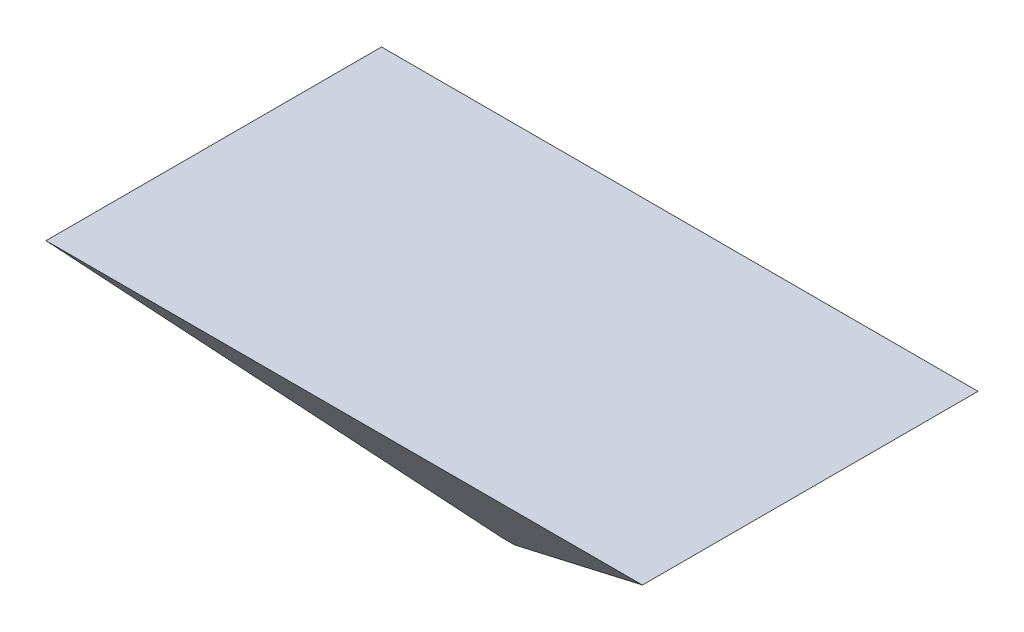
ISO-10303-21;
HEADER;
FILE_DESCRIPTION(('STEP AP214'),'2;1');
FILE_NAME('part.step','',(''),(''),'','','');
FILE_SCHEMA(('AUTOMOTIVE_DESIGN { 1 0 10303 214 1 1 1 1 }'));
ENDSEC;
DATA;
#1=APPLICATION_CONTEXT('core data for automotive mechanical design processes');
#2=APPLICATION_PROTOCOL_DEFINITION('international standard','automotive_design',2000,#1);
#3=PRODUCT_CONTEXT('',#1,'mechanical');
#4=PRODUCT('Part','Part','',(#3));
#5=PRODUCT_RELATED_PRODUCT_CATEGORY('part','',(#4));
#6=PRODUCT_DEFINITION_FORMATION('','',#4);
#7=PRODUCT_DEFINITION_CONTEXT('part definition',#1,'design');
#8=PRODUCT_DEFINITION('design','',#6,#7);
#9=PRODUCT_DEFINITION_SHAPE('','',#8);
#10=(LENGTH_UNIT() NAMED_UNIT(*) SI_UNIT(.MILLI.,.METRE.));
#11=(NAMED_UNIT(*) PLANE_ANGLE_UNIT() SI_UNIT($,.RADIAN.));
#12=(NAMED_UNIT(*) SI_UNIT($,.STERADIAN.) SOLID_ANGLE_UNIT());
#13=UNCERTAINTY_MEASURE_WITH_UNIT(LENGTH_MEASURE(1.E-05),#10,'distance_accuracy_value','');
#14=(GEOMETRIC_REPRESENTATION_CONTEXT(3) GLOBAL_UNCERTAINTY_ASSIGNED_CONTEXT((#13)) GLOBAL_UNIT_ASSIGNED_CONTEXT((#10,
#11,#12)) REPRESENTATION_CONTEXT('',''));
#15=CARTESIAN_POINT('',(0.,0.,0.));
#16=DIRECTION('',(0.,0.,1.));
#17=DIRECTION('',(1.,0.,0.));
#18=AXIS2_PLACEMENT_3D('',#15,#16,#17);
#19=CARTESIAN_POINT('',(0.,1.,0.));
#20=DIRECTION('',(0.,-1.,0.));
#21=DIRECTION('',(0.,0.,-1.));
#22=AXIS2_PLACEMENT_3D('',#19,#20,#21);
#23=PLANE('',#22);
#24=DIRECTION('',(0.,0.,1.));
#25=VECTOR('',#24,1.);
#26=CARTESIAN_POINT('',(-1.50961311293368,1.,0.849157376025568));
#27=LINE('',#26,#25);
#28=CARTESIAN_POINT('',(-1.50961311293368,1.,-0.849157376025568));
#29=VERTEX_POINT('',#28);
#30=CARTESIAN_POINT('',(-1.50961311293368,1.,0.849157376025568));
#31=VERTEX_POINT('',#30);
#32=EDGE_CURVE('E196',#29,#31,#27,.T.);
#33=ORIENTED_EDGE('',*,*,#32,.F.);
#34=DIRECTION('',(-1.,0.,0.));
#35=VECTOR('',#34,1.);
#36=CARTESIAN_POINT('',(-1.50961311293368,1.,-0.849157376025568));
#37=LINE('',#36,#35);
#38=CARTESIAN_POINT('',(1.50961311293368,1.,-0.849157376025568));
#39=VERTEX_POINT('',#38);
#40=EDGE_CURVE('E121',#39,#29,#37,.T.);
#41=ORIENTED_EDGE('',*,*,#40,.F.);
#42=DIRECTION('',(0.,0.,-1.));
#43=VECTOR('',#42,1.);
#44=CARTESIAN_POINT('',(1.50961311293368,1.,-0.849157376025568));
#45=LINE('',#44,#43);
#46=CARTESIAN_POINT('',(1.50961311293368,1.,0.849157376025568));
#47=VERTEX_POINT('',#46);
#48=EDGE_CURVE('E57',#47,#39,#45,.T.);
#49=ORIENTED_EDGE('',*,*,#48,.F.);
#50=DIRECTION('',(1.,0.,0.));
#51=VECTOR('',#50,1.);
#52=CARTESIAN_POINT('',(1.50961311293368,1.,0.849157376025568));
#53=LINE('',#52,#51);
#54=EDGE_CURVE('E12',#31,#47,#53,.T.);
#55=ORIENTED_EDGE('',*,*,#54,.F.);
#56=EDGE_LOOP('',(#33,#41,#49,#55));
#57=FACE_BOUND('',#56,.T.);
#58=ADVANCED_FACE('F47',(#57),#23,.T.);
#59=CARTESIAN_POINT('',(0.,50.,0.));
#60=DIRECTION('',(0.,-1.,0.));
#61=DIRECTION('',(0.,0.,-1.));
#62=AXIS2_PLACEMENT_3D('',#59,#60,#61);
#63=PLANE('',#62);
#64=DIRECTION('',(0.,0.,1.));
#65=VECTOR('',#64,1.);
#66=CARTESIAN_POINT('',(-75.480655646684,50.,42.4578688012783));
#67=LINE('',#66,#65);
#68=CARTESIAN_POINT('',(-75.4806556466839,50.,-42.4578688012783));
#69=VERTEX_POINT('',#68);
#70=CARTESIAN_POINT('',(-75.480655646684,50.,42.4578688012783));
#71=VERTEX_POINT('',#70);
#72=EDGE_CURVE('E96',#69,#71,#67,.T.);
#73=ORIENTED_EDGE('',*,*,#72,.T.);
#74=DIRECTION('',(1.,0.,0.));
#75=VECTOR('',#74,1.);
#76=CARTESIAN_POINT('',(75.4806556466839,50.,42.4578688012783));
#77=LINE('',#76,#75);
#78=CARTESIAN_POINT('',(75.4806556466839,50.,42.4578688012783));
#79=VERTEX_POINT('',#78);
#80=EDGE_CURVE('E126',#71,#79,#77,.T.);
#81=ORIENTED_EDGE('',*,*,#80,.T.);
#82=DIRECTION('',(0.,0.,-1.));
#83=VECTOR('',#82,1.);
#84=CARTESIAN_POINT('',(75.4806556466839,50.,-42.4578688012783));
#85=LINE('',#84,#83);
#86=CARTESIAN_POINT('',(75.4806556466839,50.,-42.4578688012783));
#87=VERTEX_POINT('',#86);
#88=EDGE_CURVE('E98',#79,#87,#85,.T.);
#89=ORIENTED_EDGE('',*,*,#88,.T.);
#90=DIRECTION('',(-1.,0.,0.));
#91=VECTOR('',#90,1.);
#92=CARTESIAN_POINT('',(-75.4806556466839,50.,-42.4578688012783));
#93=LINE('',#92,#91);
#94=EDGE_CURVE('E92',#87,#69,#93,.T.);
#95=ORIENTED_EDGE('',*,*,#94,.T.);
#96=EDGE_LOOP('',(#73,#81,#89,#95));
#97=FACE_BOUND('',#96,.T.);
#98=ADVANCED_FACE('F95',(#97),#63,.F.);
#99=CARTESIAN_POINT('',(0.,0.,0.));
#100=DIRECTION('',(0.,0.64727545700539,0.762256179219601));
#101=DIRECTION('',(0.,-0.762256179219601,0.64727545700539));
#102=AXIS2_PLACEMENT_3D('',#99,#100,#101);
#103=PLANE('',#102);
#104=DIRECTION('',(-0.754806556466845,-0.500000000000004,0.424578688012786));
#105=VECTOR('',#104,1.);
#106=CARTESIAN_POINT('',(75.4806556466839,50.,-42.4578688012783));
#107=LINE('',#106,#105);
#108=EDGE_CURVE('E123',#87,#39,#107,.T.);
#109=ORIENTED_EDGE('',*,*,#108,.T.);
#110=ORIENTED_EDGE('',*,*,#40,.T.);
#111=DIRECTION('',(0.754806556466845,-0.500000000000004,0.424578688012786));
#112=VECTOR('',#111,1.);
#113=CARTESIAN_POINT('',(-75.4806556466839,50.,-42.4578688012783));
#114=LINE('',#113,#112);
#115=EDGE_CURVE('E112',#69,#29,#114,.T.);
#116=ORIENTED_EDGE('',*,*,#115,.F.);
#117=ORIENTED_EDGE('',*,*,#94,.F.);
#118=EDGE_LOOP('',(#109,#110,#116,#117));
#119=FACE_BOUND('',#118,.T.);
#120=ADVANCED_FACE('F119',(#119),#103,.F.);
#121=CARTESIAN_POINT('',(0.,0.,0.));
#122=DIRECTION('',(-0.552247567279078,-0.83368016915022,0.));
#123=DIRECTION('',(0.83368016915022,-0.552247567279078,0.));
#124=AXIS2_PLACEMENT_3D('',#121,#122,#123);
#125=PLANE('',#124);
#126=ORIENTED_EDGE('',*,*,#115,.T.);
#127=ORIENTED_EDGE('',*,*,#32,.T.);
#128=DIRECTION('',(0.754806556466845,-0.500000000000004,-0.424578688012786));
#129=VECTOR('',#128,1.);
#130=CARTESIAN_POINT('',(-75.480655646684,50.,42.4578688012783));
#131=LINE('',#130,#129);
#132=EDGE_CURVE('E114',#71,#31,#131,.T.);
#133=ORIENTED_EDGE('',*,*,#132,.F.);
#134=ORIENTED_EDGE('',*,*,#72,.F.);
#135=EDGE_LOOP('',(#126,#127,#133,#134));
#136=FACE_BOUND('',#135,.T.);
#137=ADVANCED_FACE('F111',(#136),#125,.T.);
#138=CARTESIAN_POINT('',(0.,0.,0.));
#139=DIRECTION('',(0.552247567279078,-0.83368016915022,0.));
#140=DIRECTION('',(0.83368016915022,0.552247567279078,0.));
#141=AXIS2_PLACEMENT_3D('',#138,#139,#140);
#142=PLANE('',#141);
#143=DIRECTION('',(-0.754806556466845,-0.500000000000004,-0.424578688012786));
#144=VECTOR('',#143,1.);
#145=CARTESIAN_POINT('',(75.4806556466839,50.,42.4578688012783));
#146=LINE('',#145,#144);
#147=EDGE_CURVE('E72',#79,#47,#146,.T.);
#148=ORIENTED_EDGE('',*,*,#147,.T.);
#149=ORIENTED_EDGE('',*,*,#48,.T.);
#150=ORIENTED_EDGE('',*,*,#108,.F.);
#151=ORIENTED_EDGE('',*,*,#88,.F.);
#152=EDGE_LOOP('',(#148,#149,#150,#151));
#153=FACE_BOUND('',#152,.T.);
#154=ADVANCED_FACE('F165',(#153),#142,.T.);
#155=CARTESIAN_POINT('',(0.,0.,0.));
#156=DIRECTION('',(0.,0.64727545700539,-0.762256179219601));
#157=DIRECTION('',(0.,0.762256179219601,0.64727545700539));
#158=AXIS2_PLACEMENT_3D('',#155,#156,#157);
#159=PLANE('',#158);
#160=ORIENTED_EDGE('',*,*,#132,.T.);
#161=ORIENTED_EDGE('',*,*,#54,.T.);
#162=ORIENTED_EDGE('',*,*,#147,.F.);
#163=ORIENTED_EDGE('',*,*,#80,.F.);
#164=EDGE_LOOP('',(#160,#161,#162,#163));
#165=FACE_BOUND('',#164,.T.);
#166=ADVANCED_FACE('F173',(#165),#159,.F.);
#167=CLOSED_SHELL('',(#58,#98,#120,#137,#154,#166));
#168=MANIFOLD_SOLID_BREP('B2',#167);
#169=ADVANCED_BREP_SHAPE_REPRESENTATION('',(#18,#168),#14);
#170=SHAPE_DEFINITION_REPRESENTATION(#9,#169);
ENDSEC;
END-ISO-10303-21;
